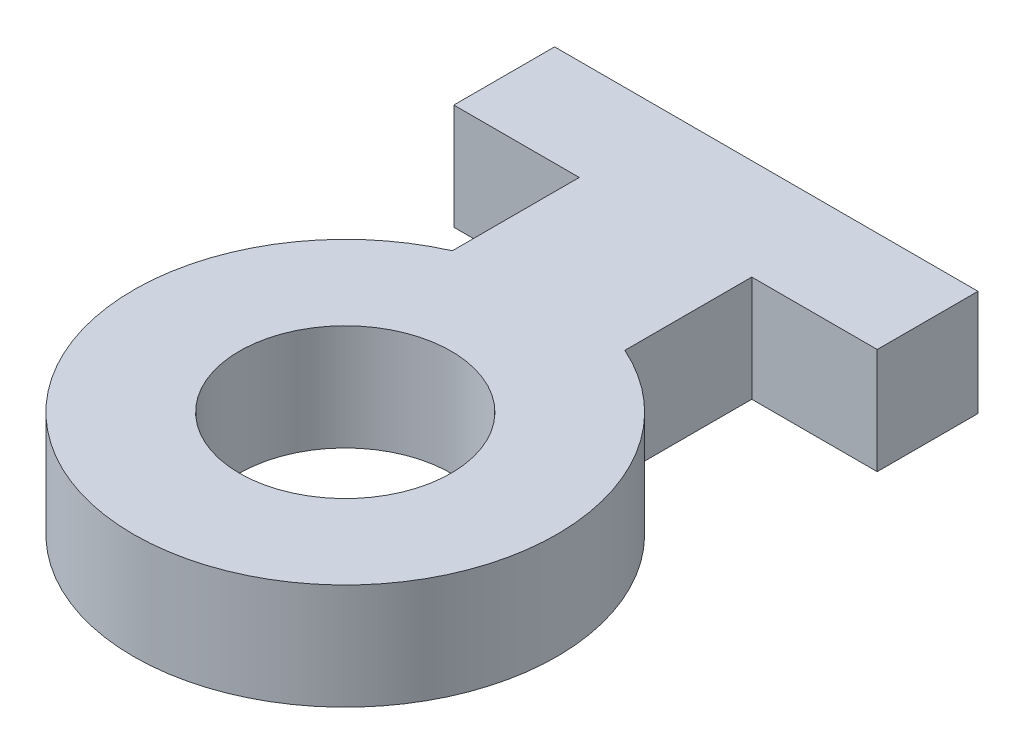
from build123d import *

# Parameters (mm, degrees)
SKETCH1_R           = 3.175
BOSS_EXTRUDE1_DEPTH = 3.175


with BuildPart() as part:
    # Sketch1 → Boss-Extrude1 (new body)
    with BuildSketch(Plane(origin=(0, 0, 0), x_dir=(1, 0, 0), z_dir=(0, 1, 0))):
        with BuildLine():
            Line((-2.587266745, 9.606457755), (-2.587266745, 5.799012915))
            ThreePointArc((-2.587266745, 5.799012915), (0, -6.35), (2.587266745, 5.799012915))
            Line((2.587266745, 5.799012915), (2.587266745, 9.606457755))
            Line((2.587266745, 9.606457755), (6.35, 9.606457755))
            Line((6.35, 9.606457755), (6.35, 12.629669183))
            Line((6.35, 12.629669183), (-6.35, 12.629669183))
            Line((-6.35, 12.629669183), (-6.35, 9.606457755))
            Line((-6.35, 9.606457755), (-2.587266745, 9.606457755))
        make_face()
        with Locations(Location((0, 0, 0), (0, 0, 270))):
            Circle(SKETCH1_R, mode=Mode.SUBTRACT)
    extrude(amount=BOSS_EXTRUDE1_DEPTH)


solid = part.part
